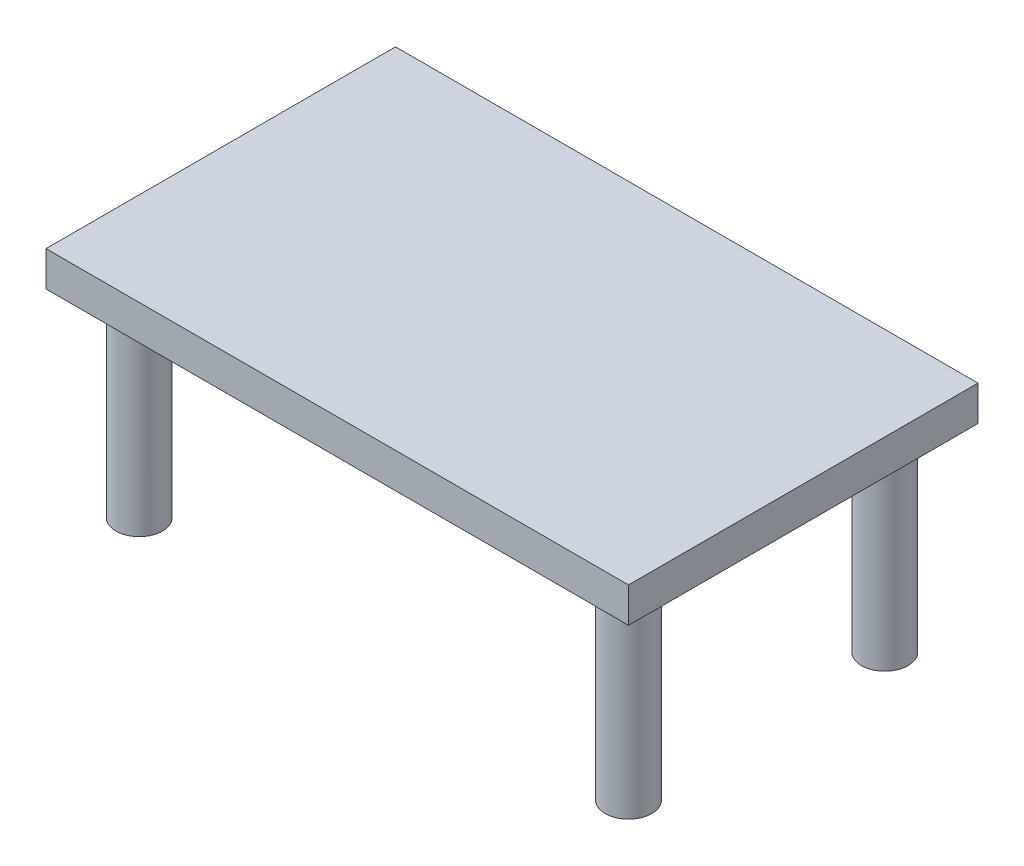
ISO-10303-21;
HEADER;
FILE_DESCRIPTION(('STEP AP214'),'2;1');
FILE_NAME('part.step','',(''),(''),'','','');
FILE_SCHEMA(('AUTOMOTIVE_DESIGN { 1 0 10303 214 1 1 1 1 }'));
ENDSEC;
DATA;
#1=APPLICATION_CONTEXT('core data for automotive mechanical design processes');
#2=APPLICATION_PROTOCOL_DEFINITION('international standard','automotive_design',2000,#1);
#3=PRODUCT_CONTEXT('',#1,'mechanical');
#4=PRODUCT('Part','Part','',(#3));
#5=PRODUCT_RELATED_PRODUCT_CATEGORY('part','',(#4));
#6=PRODUCT_DEFINITION_FORMATION('','',#4);
#7=PRODUCT_DEFINITION_CONTEXT('part definition',#1,'design');
#8=PRODUCT_DEFINITION('design','',#6,#7);
#9=PRODUCT_DEFINITION_SHAPE('','',#8);
#10=(LENGTH_UNIT() NAMED_UNIT(*) SI_UNIT(.MILLI.,.METRE.));
#11=(NAMED_UNIT(*) PLANE_ANGLE_UNIT() SI_UNIT($,.RADIAN.));
#12=(NAMED_UNIT(*) SI_UNIT($,.STERADIAN.) SOLID_ANGLE_UNIT());
#13=UNCERTAINTY_MEASURE_WITH_UNIT(LENGTH_MEASURE(1.E-05),#10,'distance_accuracy_value','');
#14=(GEOMETRIC_REPRESENTATION_CONTEXT(3) GLOBAL_UNCERTAINTY_ASSIGNED_CONTEXT((#13)) GLOBAL_UNIT_ASSIGNED_CONTEXT((#10,
#11,#12)) REPRESENTATION_CONTEXT('',''));
#15=CARTESIAN_POINT('',(0.,0.,0.));
#16=DIRECTION('',(0.,0.,1.));
#17=DIRECTION('',(1.,0.,0.));
#18=AXIS2_PLACEMENT_3D('',#15,#16,#17);
#19=CARTESIAN_POINT('',(250.,170.,150.));
#20=DIRECTION('',(0.,-1.,0.));
#21=DIRECTION('',(0.,0.,-1.));
#22=AXIS2_PLACEMENT_3D('',#19,#20,#21);
#23=PLANE('',#22);
#24=CARTESIAN_POINT('',(-210.,170.,-110.));
#25=DIRECTION('',(0.,-1.,0.));
#26=DIRECTION('',(0.,0.,-1.));
#27=AXIS2_PLACEMENT_3D('',#24,#25,#26);
#28=CIRCLE('',#27,20.);
#29=CARTESIAN_POINT('',(-210.,170.,-130.));
#30=VERTEX_POINT('',#29);
#31=EDGE_CURVE('E11',#30,#30,#28,.T.);
#32=ORIENTED_EDGE('',*,*,#31,.F.);
#33=EDGE_LOOP('',(#32));
#34=FACE_BOUND('',#33,.T.);
#35=CARTESIAN_POINT('',(-210.,170.,110.));
#36=DIRECTION('',(0.,-1.,0.));
#37=DIRECTION('',(0.,0.,-1.));
#38=AXIS2_PLACEMENT_3D('',#35,#36,#37);
#39=CIRCLE('',#38,20.);
#40=CARTESIAN_POINT('',(-210.,170.,90.));
#41=VERTEX_POINT('',#40);
#42=EDGE_CURVE('E134',#41,#41,#39,.T.);
#43=ORIENTED_EDGE('',*,*,#42,.F.);
#44=EDGE_LOOP('',(#43));
#45=FACE_BOUND('',#44,.T.);
#46=DIRECTION('',(0.,0.,-1.));
#47=VECTOR('',#46,1.);
#48=CARTESIAN_POINT('',(250.,170.,-150.));
#49=LINE('',#48,#47);
#50=CARTESIAN_POINT('',(250.,170.,150.));
#51=VERTEX_POINT('',#50);
#52=CARTESIAN_POINT('',(250.,170.,-150.));
#53=VERTEX_POINT('',#52);
#54=EDGE_CURVE('E93',#51,#53,#49,.T.);
#55=ORIENTED_EDGE('',*,*,#54,.F.);
#56=DIRECTION('',(1.,0.,0.));
#57=VECTOR('',#56,1.);
#58=CARTESIAN_POINT('',(250.,170.,150.));
#59=LINE('',#58,#57);
#60=CARTESIAN_POINT('',(-250.,170.,150.));
#61=VERTEX_POINT('',#60);
#62=EDGE_CURVE('E90',#61,#51,#59,.T.);
#63=ORIENTED_EDGE('',*,*,#62,.F.);
#64=DIRECTION('',(0.,0.,1.));
#65=VECTOR('',#64,1.);
#66=CARTESIAN_POINT('',(-250.,170.,-150.));
#67=LINE('',#66,#65);
#68=CARTESIAN_POINT('',(-250.,170.,-150.));
#69=VERTEX_POINT('',#68);
#70=EDGE_CURVE('E82',#69,#61,#67,.T.);
#71=ORIENTED_EDGE('',*,*,#70,.F.);
#72=DIRECTION('',(-1.,0.,0.));
#73=VECTOR('',#72,1.);
#74=CARTESIAN_POINT('',(250.,170.,-150.));
#75=LINE('',#74,#73);
#76=EDGE_CURVE('E89',#53,#69,#75,.T.);
#77=ORIENTED_EDGE('',*,*,#76,.F.);
#78=EDGE_LOOP('',(#55,#63,#71,#77));
#79=FACE_BOUND('',#78,.T.);
#80=CARTESIAN_POINT('',(210.,170.,110.));
#81=DIRECTION('',(0.,-1.,0.));
#82=DIRECTION('',(0.,0.,-1.));
#83=AXIS2_PLACEMENT_3D('',#80,#81,#82);
#84=CIRCLE('',#83,20.);
#85=CARTESIAN_POINT('',(210.,170.,90.));
#86=VERTEX_POINT('',#85);
#87=EDGE_CURVE('E40',#86,#86,#84,.T.);
#88=ORIENTED_EDGE('',*,*,#87,.F.);
#89=EDGE_LOOP('',(#88));
#90=FACE_BOUND('',#89,.T.);
#91=CARTESIAN_POINT('',(210.,170.,-110.));
#92=DIRECTION('',(0.,-1.,0.));
#93=DIRECTION('',(0.,0.,1.));
#94=AXIS2_PLACEMENT_3D('',#91,#92,#93);
#95=CIRCLE('',#94,20.);
#96=CARTESIAN_POINT('',(210.,170.,-90.));
#97=VERTEX_POINT('',#96);
#98=EDGE_CURVE('E121',#97,#97,#95,.T.);
#99=ORIENTED_EDGE('',*,*,#98,.F.);
#100=EDGE_LOOP('',(#99));
#101=FACE_BOUND('',#100,.T.);
#102=ADVANCED_FACE('F31',(#34,#45,#79,#90,#101),#23,.T.);
#103=CARTESIAN_POINT('',(250.,170.,-150.));
#104=DIRECTION('',(1.,0.,0.));
#105=DIRECTION('',(0.,0.,-1.));
#106=AXIS2_PLACEMENT_3D('',#103,#104,#105);
#107=PLANE('',#106);
#108=DIRECTION('',(0.,0.,-1.));
#109=VECTOR('',#108,1.);
#110=CARTESIAN_POINT('',(250.,200.,-150.));
#111=LINE('',#110,#109);
#112=CARTESIAN_POINT('',(250.,200.,150.));
#113=VERTEX_POINT('',#112);
#114=CARTESIAN_POINT('',(250.,200.,-150.));
#115=VERTEX_POINT('',#114);
#116=EDGE_CURVE('E100',#113,#115,#111,.T.);
#117=ORIENTED_EDGE('',*,*,#116,.F.);
#118=DIRECTION('',(0.,1.,0.));
#119=VECTOR('',#118,1.);
#120=CARTESIAN_POINT('',(250.,170.,150.));
#121=LINE('',#120,#119);
#122=EDGE_CURVE('E48',#51,#113,#121,.T.);
#123=ORIENTED_EDGE('',*,*,#122,.F.);
#124=ORIENTED_EDGE('',*,*,#54,.T.);
#125=DIRECTION('',(0.,1.,0.));
#126=VECTOR('',#125,1.);
#127=CARTESIAN_POINT('',(250.,170.,-150.));
#128=LINE('',#127,#126);
#129=EDGE_CURVE('E76',#53,#115,#128,.T.);
#130=ORIENTED_EDGE('',*,*,#129,.T.);
#131=EDGE_LOOP('',(#117,#123,#124,#130));
#132=FACE_BOUND('',#131,.T.);
#133=ADVANCED_FACE('F33',(#132),#107,.T.);
#134=CARTESIAN_POINT('',(250.,170.,150.));
#135=DIRECTION('',(0.,0.,1.));
#136=DIRECTION('',(1.,0.,0.));
#137=AXIS2_PLACEMENT_3D('',#134,#135,#136);
#138=PLANE('',#137);
#139=DIRECTION('',(1.,0.,0.));
#140=VECTOR('',#139,1.);
#141=CARTESIAN_POINT('',(250.,200.,150.));
#142=LINE('',#141,#140);
#143=CARTESIAN_POINT('',(-250.,200.,150.));
#144=VERTEX_POINT('',#143);
#145=EDGE_CURVE('E95',#144,#113,#142,.T.);
#146=ORIENTED_EDGE('',*,*,#145,.F.);
#147=DIRECTION('',(0.,1.,0.));
#148=VECTOR('',#147,1.);
#149=CARTESIAN_POINT('',(-250.,170.,150.));
#150=LINE('',#149,#148);
#151=EDGE_CURVE('E65',#61,#144,#150,.T.);
#152=ORIENTED_EDGE('',*,*,#151,.F.);
#153=ORIENTED_EDGE('',*,*,#62,.T.);
#154=ORIENTED_EDGE('',*,*,#122,.T.);
#155=EDGE_LOOP('',(#146,#152,#153,#154));
#156=FACE_BOUND('',#155,.T.);
#157=ADVANCED_FACE('F159',(#156),#138,.T.);
#158=CARTESIAN_POINT('',(-250.,170.,-150.));
#159=DIRECTION('',(-1.,0.,0.));
#160=DIRECTION('',(0.,0.,1.));
#161=AXIS2_PLACEMENT_3D('',#158,#159,#160);
#162=PLANE('',#161);
#163=DIRECTION('',(0.,0.,1.));
#164=VECTOR('',#163,1.);
#165=CARTESIAN_POINT('',(-250.,200.,-150.));
#166=LINE('',#165,#164);
#167=CARTESIAN_POINT('',(-250.,200.,-150.));
#168=VERTEX_POINT('',#167);
#169=EDGE_CURVE('E84',#168,#144,#166,.T.);
#170=ORIENTED_EDGE('',*,*,#169,.F.);
#171=DIRECTION('',(0.,1.,0.));
#172=VECTOR('',#171,1.);
#173=CARTESIAN_POINT('',(-250.,170.,-150.));
#174=LINE('',#173,#172);
#175=EDGE_CURVE('E79',#69,#168,#174,.T.);
#176=ORIENTED_EDGE('',*,*,#175,.F.);
#177=ORIENTED_EDGE('',*,*,#70,.T.);
#178=ORIENTED_EDGE('',*,*,#151,.T.);
#179=EDGE_LOOP('',(#170,#176,#177,#178));
#180=FACE_BOUND('',#179,.T.);
#181=ADVANCED_FACE('F81',(#180),#162,.T.);
#182=CARTESIAN_POINT('',(250.,170.,-150.));
#183=DIRECTION('',(0.,0.,-1.));
#184=DIRECTION('',(-1.,0.,0.));
#185=AXIS2_PLACEMENT_3D('',#182,#183,#184);
#186=PLANE('',#185);
#187=DIRECTION('',(-1.,0.,0.));
#188=VECTOR('',#187,1.);
#189=CARTESIAN_POINT('',(250.,200.,-150.));
#190=LINE('',#189,#188);
#191=EDGE_CURVE('E103',#115,#168,#190,.T.);
#192=ORIENTED_EDGE('',*,*,#191,.F.);
#193=ORIENTED_EDGE('',*,*,#129,.F.);
#194=ORIENTED_EDGE('',*,*,#76,.T.);
#195=ORIENTED_EDGE('',*,*,#175,.T.);
#196=EDGE_LOOP('',(#192,#193,#194,#195));
#197=FACE_BOUND('',#196,.T.);
#198=ADVANCED_FACE('F92',(#197),#186,.T.);
#199=CARTESIAN_POINT('',(250.,200.,150.));
#200=DIRECTION('',(0.,-1.,0.));
#201=DIRECTION('',(0.,0.,-1.));
#202=AXIS2_PLACEMENT_3D('',#199,#200,#201);
#203=PLANE('',#202);
#204=ORIENTED_EDGE('',*,*,#116,.T.);
#205=ORIENTED_EDGE('',*,*,#191,.T.);
#206=ORIENTED_EDGE('',*,*,#169,.T.);
#207=ORIENTED_EDGE('',*,*,#145,.T.);
#208=EDGE_LOOP('',(#204,#205,#206,#207));
#209=FACE_BOUND('',#208,.T.);
#210=ADVANCED_FACE('F152',(#209),#203,.F.);
#211=CARTESIAN_POINT('',(-210.,-56.5685424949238,110.));
#212=DIRECTION('',(0.,1.,0.));
#213=DIRECTION('',(0.,0.,1.));
#214=AXIS2_PLACEMENT_3D('',#211,#212,#213);
#215=CYLINDRICAL_SURFACE('',#214,20.);
#216=CARTESIAN_POINT('',(-210.,0.,110.));
#217=DIRECTION('',(0.,1.,0.));
#218=DIRECTION('',(0.,0.,1.));
#219=AXIS2_PLACEMENT_3D('',#216,#217,#218);
#220=CIRCLE('',#219,20.);
#221=CARTESIAN_POINT('',(-210.,0.,130.));
#222=VERTEX_POINT('',#221);
#223=EDGE_CURVE('E104',#222,#222,#220,.T.);
#224=ORIENTED_EDGE('',*,*,#223,.T.);
#225=EDGE_LOOP('',(#224));
#226=FACE_BOUND('',#225,.T.);
#227=ORIENTED_EDGE('',*,*,#42,.T.);
#228=EDGE_LOOP('',(#227));
#229=FACE_BOUND('',#228,.T.);
#230=ADVANCED_FACE('F139',(#226,#229),#215,.T.);
#231=CARTESIAN_POINT('',(0.,0.,0.));
#232=DIRECTION('',(0.,1.,0.));
#233=DIRECTION('',(0.,0.,1.));
#234=AXIS2_PLACEMENT_3D('',#231,#232,#233);
#235=PLANE('',#234);
#236=ORIENTED_EDGE('',*,*,#223,.F.);
#237=EDGE_LOOP('',(#236));
#238=FACE_BOUND('',#237,.T.);
#239=ADVANCED_FACE('F142',(#238),#235,.F.);
#240=CARTESIAN_POINT('',(210.,-56.5685424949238,110.));
#241=DIRECTION('',(0.,1.,0.));
#242=DIRECTION('',(0.,0.,1.));
#243=AXIS2_PLACEMENT_3D('',#240,#241,#242);
#244=CYLINDRICAL_SURFACE('',#243,20.);
#245=CARTESIAN_POINT('',(210.,0.,110.));
#246=DIRECTION('',(0.,1.,0.));
#247=DIRECTION('',(0.,0.,1.));
#248=AXIS2_PLACEMENT_3D('',#245,#246,#247);
#249=CIRCLE('',#248,20.);
#250=CARTESIAN_POINT('',(210.,0.,130.));
#251=VERTEX_POINT('',#250);
#252=EDGE_CURVE('E127',#251,#251,#249,.F.);
#253=ORIENTED_EDGE('',*,*,#252,.F.);
#254=EDGE_LOOP('',(#253));
#255=FACE_BOUND('',#254,.T.);
#256=ORIENTED_EDGE('',*,*,#87,.T.);
#257=EDGE_LOOP('',(#256));
#258=FACE_BOUND('',#257,.T.);
#259=ADVANCED_FACE('F114',(#255,#258),#244,.T.);
#260=CARTESIAN_POINT('',(0.,0.,0.));
#261=DIRECTION('',(0.,1.,0.));
#262=DIRECTION('',(0.,0.,1.));
#263=AXIS2_PLACEMENT_3D('',#260,#261,#262);
#264=PLANE('',#263);
#265=ORIENTED_EDGE('',*,*,#252,.T.);
#266=EDGE_LOOP('',(#265));
#267=FACE_BOUND('',#266,.T.);
#268=ADVANCED_FACE('F149',(#267),#264,.F.);
#269=CARTESIAN_POINT('',(210.,-56.5685424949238,-110.));
#270=DIRECTION('',(0.,1.,0.));
#271=DIRECTION('',(0.,0.,1.));
#272=AXIS2_PLACEMENT_3D('',#269,#270,#271);
#273=CYLINDRICAL_SURFACE('',#272,20.);
#274=CARTESIAN_POINT('',(210.,0.,-110.));
#275=DIRECTION('',(0.,1.,0.));
#276=DIRECTION('',(0.,0.,1.));
#277=AXIS2_PLACEMENT_3D('',#274,#275,#276);
#278=CIRCLE('',#277,20.);
#279=CARTESIAN_POINT('',(210.,0.,-90.));
#280=VERTEX_POINT('',#279);
#281=EDGE_CURVE('E123',#280,#280,#278,.T.);
#282=ORIENTED_EDGE('',*,*,#281,.T.);
#283=EDGE_LOOP('',(#282));
#284=FACE_BOUND('',#283,.T.);
#285=ORIENTED_EDGE('',*,*,#98,.T.);
#286=EDGE_LOOP('',(#285));
#287=FACE_BOUND('',#286,.T.);
#288=ADVANCED_FACE('F195',(#284,#287),#273,.T.);
#289=CARTESIAN_POINT('',(0.,0.,0.));
#290=DIRECTION('',(0.,1.,0.));
#291=DIRECTION('',(0.,0.,1.));
#292=AXIS2_PLACEMENT_3D('',#289,#290,#291);
#293=PLANE('',#292);
#294=ORIENTED_EDGE('',*,*,#281,.F.);
#295=EDGE_LOOP('',(#294));
#296=FACE_BOUND('',#295,.T.);
#297=ADVANCED_FACE('F211',(#296),#293,.F.);
#298=CARTESIAN_POINT('',(-210.,-56.5685424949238,-110.));
#299=DIRECTION('',(0.,1.,0.));
#300=DIRECTION('',(0.,0.,1.));
#301=AXIS2_PLACEMENT_3D('',#298,#299,#300);
#302=CYLINDRICAL_SURFACE('',#301,20.);
#303=CARTESIAN_POINT('',(-210.,0.,-110.));
#304=DIRECTION('',(0.,1.,0.));
#305=DIRECTION('',(0.,0.,1.));
#306=AXIS2_PLACEMENT_3D('',#303,#304,#305);
#307=CIRCLE('',#306,20.);
#308=CARTESIAN_POINT('',(-210.,0.,-90.));
#309=VERTEX_POINT('',#308);
#310=EDGE_CURVE('E124',#309,#309,#307,.F.);
#311=ORIENTED_EDGE('',*,*,#310,.F.);
#312=EDGE_LOOP('',(#311));
#313=FACE_BOUND('',#312,.T.);
#314=ORIENTED_EDGE('',*,*,#31,.T.);
#315=EDGE_LOOP('',(#314));
#316=FACE_BOUND('',#315,.T.);
#317=ADVANCED_FACE('F221',(#313,#316),#302,.T.);
#318=CARTESIAN_POINT('',(0.,0.,0.));
#319=DIRECTION('',(0.,1.,0.));
#320=DIRECTION('',(0.,0.,1.));
#321=AXIS2_PLACEMENT_3D('',#318,#319,#320);
#322=PLANE('',#321);
#323=ORIENTED_EDGE('',*,*,#310,.T.);
#324=EDGE_LOOP('',(#323));
#325=FACE_BOUND('',#324,.T.);
#326=ADVANCED_FACE('F231',(#325),#322,.F.);
#327=CLOSED_SHELL('',(#102,#133,#157,#181,#198,#210,#230,#239,#259,#268,#288,#297,#317,#326));
#328=MANIFOLD_SOLID_BREP('B2',#327);
#329=ADVANCED_BREP_SHAPE_REPRESENTATION('',(#18,#328),#14);
#330=SHAPE_DEFINITION_REPRESENTATION(#9,#329);
ENDSEC;
END-ISO-10303-21;
